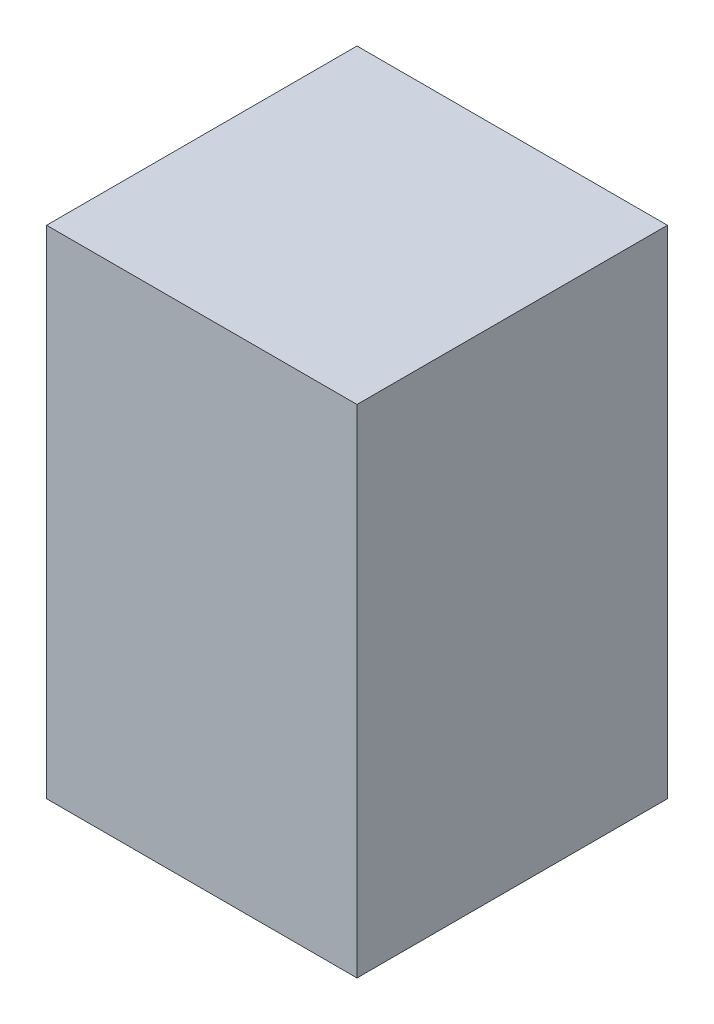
ISO-10303-21;
HEADER;
FILE_DESCRIPTION(('STEP AP214'),'2;1');
FILE_NAME('part.step','',(''),(''),'','','');
FILE_SCHEMA(('AUTOMOTIVE_DESIGN { 1 0 10303 214 1 1 1 1 }'));
ENDSEC;
DATA;
#1=APPLICATION_CONTEXT('core data for automotive mechanical design processes');
#2=APPLICATION_PROTOCOL_DEFINITION('international standard','automotive_design',2000,#1);
#3=PRODUCT_CONTEXT('',#1,'mechanical');
#4=PRODUCT('Part','Part','',(#3));
#5=PRODUCT_RELATED_PRODUCT_CATEGORY('part','',(#4));
#6=PRODUCT_DEFINITION_FORMATION('','',#4);
#7=PRODUCT_DEFINITION_CONTEXT('part definition',#1,'design');
#8=PRODUCT_DEFINITION('design','',#6,#7);
#9=PRODUCT_DEFINITION_SHAPE('','',#8);
#10=(LENGTH_UNIT() NAMED_UNIT(*) SI_UNIT(.MILLI.,.METRE.));
#11=(NAMED_UNIT(*) PLANE_ANGLE_UNIT() SI_UNIT($,.RADIAN.));
#12=(NAMED_UNIT(*) SI_UNIT($,.STERADIAN.) SOLID_ANGLE_UNIT());
#13=UNCERTAINTY_MEASURE_WITH_UNIT(LENGTH_MEASURE(1.E-05),#10,'distance_accuracy_value','');
#14=(GEOMETRIC_REPRESENTATION_CONTEXT(3) GLOBAL_UNCERTAINTY_ASSIGNED_CONTEXT((#13)) GLOBAL_UNIT_ASSIGNED_CONTEXT((#10,
#11,#12)) REPRESENTATION_CONTEXT('',''));
#15=CARTESIAN_POINT('',(0.,0.,0.));
#16=DIRECTION('',(0.,0.,1.));
#17=DIRECTION('',(1.,0.,0.));
#18=AXIS2_PLACEMENT_3D('',#15,#16,#17);
#19=CARTESIAN_POINT('',(-15.875,50.8,15.875));
#20=DIRECTION('',(-1.,0.,0.));
#21=DIRECTION('',(0.,0.,1.));
#22=AXIS2_PLACEMENT_3D('',#19,#20,#21);
#23=PLANE('',#22);
#24=DIRECTION('',(0.,0.,-1.));
#25=VECTOR('',#24,1.);
#26=CARTESIAN_POINT('',(-15.875,0.,15.875));
#27=LINE('',#26,#25);
#28=CARTESIAN_POINT('',(-15.875,0.,15.875));
#29=VERTEX_POINT('',#28);
#30=CARTESIAN_POINT('',(-15.875,0.,-15.875));
#31=VERTEX_POINT('',#30);
#32=EDGE_CURVE('E100',#29,#31,#27,.T.);
#33=ORIENTED_EDGE('',*,*,#32,.F.);
#34=DIRECTION('',(0.,-1.,0.));
#35=VECTOR('',#34,1.);
#36=CARTESIAN_POINT('',(-15.875,50.8,15.875));
#37=LINE('',#36,#35);
#38=CARTESIAN_POINT('',(-15.875,50.8,15.875));
#39=VERTEX_POINT('',#38);
#40=EDGE_CURVE('E11',#39,#29,#37,.T.);
#41=ORIENTED_EDGE('',*,*,#40,.F.);
#42=DIRECTION('',(0.,0.,-1.));
#43=VECTOR('',#42,1.);
#44=CARTESIAN_POINT('',(-15.875,50.8,15.875));
#45=LINE('',#44,#43);
#46=CARTESIAN_POINT('',(-15.875,50.8,-15.875));
#47=VERTEX_POINT('',#46);
#48=EDGE_CURVE('E94',#39,#47,#45,.T.);
#49=ORIENTED_EDGE('',*,*,#48,.T.);
#50=DIRECTION('',(0.,-1.,0.));
#51=VECTOR('',#50,1.);
#52=CARTESIAN_POINT('',(-15.875,50.8,-15.875));
#53=LINE('',#52,#51);
#54=EDGE_CURVE('E37',#47,#31,#53,.T.);
#55=ORIENTED_EDGE('',*,*,#54,.T.);
#56=EDGE_LOOP('',(#33,#41,#49,#55));
#57=FACE_BOUND('',#56,.T.);
#58=ADVANCED_FACE('F34',(#57),#23,.T.);
#59=CARTESIAN_POINT('',(-15.875,50.8,15.875));
#60=DIRECTION('',(0.,0.,-1.));
#61=DIRECTION('',(-1.,0.,0.));
#62=AXIS2_PLACEMENT_3D('',#59,#60,#61);
#63=PLANE('',#62);
#64=DIRECTION('',(1.,0.,0.));
#65=VECTOR('',#64,1.);
#66=CARTESIAN_POINT('',(-15.875,0.,15.875));
#67=LINE('',#66,#65);
#68=CARTESIAN_POINT('',(15.875,0.,15.875));
#69=VERTEX_POINT('',#68);
#70=EDGE_CURVE('E67',#29,#69,#67,.T.);
#71=ORIENTED_EDGE('',*,*,#70,.T.);
#72=DIRECTION('',(0.,-1.,0.));
#73=VECTOR('',#72,1.);
#74=CARTESIAN_POINT('',(15.875,50.8,15.875));
#75=LINE('',#74,#73);
#76=CARTESIAN_POINT('',(15.875,50.8,15.875));
#77=VERTEX_POINT('',#76);
#78=EDGE_CURVE('E43',#77,#69,#75,.T.);
#79=ORIENTED_EDGE('',*,*,#78,.F.);
#80=DIRECTION('',(1.,0.,0.));
#81=VECTOR('',#80,1.);
#82=CARTESIAN_POINT('',(-15.875,50.8,15.875));
#83=LINE('',#82,#81);
#84=EDGE_CURVE('E84',#39,#77,#83,.T.);
#85=ORIENTED_EDGE('',*,*,#84,.F.);
#86=ORIENTED_EDGE('',*,*,#40,.T.);
#87=EDGE_LOOP('',(#71,#79,#85,#86));
#88=FACE_BOUND('',#87,.T.);
#89=ADVANCED_FACE('F111',(#88),#63,.F.);
#90=CARTESIAN_POINT('',(15.875,50.8,15.875));
#91=DIRECTION('',(-1.,0.,0.));
#92=DIRECTION('',(0.,0.,1.));
#93=AXIS2_PLACEMENT_3D('',#90,#91,#92);
#94=PLANE('',#93);
#95=DIRECTION('',(0.,0.,-1.));
#96=VECTOR('',#95,1.);
#97=CARTESIAN_POINT('',(15.875,0.,15.875));
#98=LINE('',#97,#96);
#99=CARTESIAN_POINT('',(15.875,0.,-15.875));
#100=VERTEX_POINT('',#99);
#101=EDGE_CURVE('E91',#69,#100,#98,.T.);
#102=ORIENTED_EDGE('',*,*,#101,.T.);
#103=DIRECTION('',(0.,-1.,0.));
#104=VECTOR('',#103,1.);
#105=CARTESIAN_POINT('',(15.875,50.8,-15.875));
#106=LINE('',#105,#104);
#107=CARTESIAN_POINT('',(15.875,50.8,-15.875));
#108=VERTEX_POINT('',#107);
#109=EDGE_CURVE('E88',#108,#100,#106,.T.);
#110=ORIENTED_EDGE('',*,*,#109,.F.);
#111=DIRECTION('',(0.,0.,-1.));
#112=VECTOR('',#111,1.);
#113=CARTESIAN_POINT('',(15.875,50.8,15.875));
#114=LINE('',#113,#112);
#115=EDGE_CURVE('E79',#77,#108,#114,.T.);
#116=ORIENTED_EDGE('',*,*,#115,.F.);
#117=ORIENTED_EDGE('',*,*,#78,.T.);
#118=EDGE_LOOP('',(#102,#110,#116,#117));
#119=FACE_BOUND('',#118,.T.);
#120=ADVANCED_FACE('F89',(#119),#94,.F.);
#121=CARTESIAN_POINT('',(-15.875,50.8,-15.875));
#122=DIRECTION('',(0.,0.,-1.));
#123=DIRECTION('',(-1.,0.,0.));
#124=AXIS2_PLACEMENT_3D('',#121,#122,#123);
#125=PLANE('',#124);
#126=DIRECTION('',(1.,0.,0.));
#127=VECTOR('',#126,1.);
#128=CARTESIAN_POINT('',(-15.875,0.,-15.875));
#129=LINE('',#128,#127);
#130=EDGE_CURVE('E103',#31,#100,#129,.T.);
#131=ORIENTED_EDGE('',*,*,#130,.F.);
#132=ORIENTED_EDGE('',*,*,#54,.F.);
#133=DIRECTION('',(1.,0.,0.));
#134=VECTOR('',#133,1.);
#135=CARTESIAN_POINT('',(-15.875,50.8,-15.875));
#136=LINE('',#135,#134);
#137=EDGE_CURVE('E83',#47,#108,#136,.T.);
#138=ORIENTED_EDGE('',*,*,#137,.T.);
#139=ORIENTED_EDGE('',*,*,#109,.T.);
#140=EDGE_LOOP('',(#131,#132,#138,#139));
#141=FACE_BOUND('',#140,.T.);
#142=ADVANCED_FACE('F93',(#141),#125,.T.);
#143=CARTESIAN_POINT('',(0.,50.8,0.));
#144=DIRECTION('',(0.,-1.,0.));
#145=DIRECTION('',(0.,0.,-1.));
#146=AXIS2_PLACEMENT_3D('',#143,#144,#145);
#147=PLANE('',#146);
#148=ORIENTED_EDGE('',*,*,#48,.F.);
#149=ORIENTED_EDGE('',*,*,#84,.T.);
#150=ORIENTED_EDGE('',*,*,#115,.T.);
#151=ORIENTED_EDGE('',*,*,#137,.F.);
#152=EDGE_LOOP('',(#148,#149,#150,#151));
#153=FACE_BOUND('',#152,.T.);
#154=ADVANCED_FACE('F82',(#153),#147,.F.);
#155=CARTESIAN_POINT('',(0.,0.,0.));
#156=DIRECTION('',(0.,-1.,0.));
#157=DIRECTION('',(0.,0.,-1.));
#158=AXIS2_PLACEMENT_3D('',#155,#156,#157);
#159=PLANE('',#158);
#160=CARTESIAN_POINT('',(0.,0.,0.));
#161=DIRECTION('',(0.,-1.,0.));
#162=DIRECTION('',(0.,0.,-1.));
#163=AXIS2_PLACEMENT_3D('',#160,#161,#162);
#164=CIRCLE('',#163,4.7625);
#165=CARTESIAN_POINT('',(0.,0.,-4.7625));
#166=VERTEX_POINT('',#165);
#167=EDGE_CURVE('E142',#166,#166,#164,.T.);
#168=ORIENTED_EDGE('',*,*,#167,.F.);
#169=EDGE_LOOP('',(#168));
#170=FACE_BOUND('',#169,.T.);
#171=ORIENTED_EDGE('',*,*,#32,.T.);
#172=ORIENTED_EDGE('',*,*,#130,.T.);
#173=ORIENTED_EDGE('',*,*,#101,.F.);
#174=ORIENTED_EDGE('',*,*,#70,.F.);
#175=EDGE_LOOP('',(#171,#172,#173,#174));
#176=FACE_BOUND('',#175,.T.);
#177=ADVANCED_FACE('F109',(#170,#176),#159,.T.);
#178=CARTESIAN_POINT('',(0.,38.1,0.));
#179=DIRECTION('',(0.,-1.,0.));
#180=DIRECTION('',(0.,0.,-1.));
#181=AXIS2_PLACEMENT_3D('',#178,#179,#180);
#182=CYLINDRICAL_SURFACE('',#181,4.7625);
#183=CARTESIAN_POINT('',(0.,38.1,0.));
#184=DIRECTION('',(0.,-1.,0.));
#185=DIRECTION('',(0.,0.,-1.));
#186=AXIS2_PLACEMENT_3D('',#183,#184,#185);
#187=CIRCLE('',#186,4.7625);
#188=CARTESIAN_POINT('',(0.,38.1,-4.7625));
#189=VERTEX_POINT('',#188);
#190=EDGE_CURVE('E104',#189,#189,#187,.T.);
#191=CARTESIAN_POINT('',(0.,38.1,-4.7625));
#192=CARTESIAN_POINT('',(0.,37.703125,-4.7625));
#193=CARTESIAN_POINT('',(0.,37.30625,-4.7625));
#194=CARTESIAN_POINT('',(0.,36.5125,-4.7625));
#195=CARTESIAN_POINT('',(0.,36.115625,-4.7625));
#196=CARTESIAN_POINT('',(0.,35.321875,-4.7625));
#197=CARTESIAN_POINT('',(0.,34.925,-4.7625));
#198=CARTESIAN_POINT('',(0.,34.13125,-4.7625));
#199=CARTESIAN_POINT('',(0.,33.734375,-4.7625));
#200=CARTESIAN_POINT('',(0.,32.940625,-4.7625));
#201=CARTESIAN_POINT('',(0.,32.54375,-4.7625));
#202=CARTESIAN_POINT('',(0.,31.75,-4.7625));
#203=CARTESIAN_POINT('',(0.,31.353125,-4.7625));
#204=CARTESIAN_POINT('',(0.,30.559375,-4.7625));
#205=CARTESIAN_POINT('',(0.,30.1625,-4.7625));
#206=CARTESIAN_POINT('',(0.,29.36875,-4.7625));
#207=CARTESIAN_POINT('',(0.,28.971875,-4.7625));
#208=CARTESIAN_POINT('',(0.,28.178125,-4.7625));
#209=CARTESIAN_POINT('',(0.,27.78125,-4.7625));
#210=CARTESIAN_POINT('',(0.,26.9875,-4.7625));
#211=CARTESIAN_POINT('',(0.,26.590625,-4.7625));
#212=CARTESIAN_POINT('',(0.,25.796875,-4.7625));
#213=CARTESIAN_POINT('',(0.,25.4,-4.7625));
#214=CARTESIAN_POINT('',(0.,24.60625,-4.7625));
#215=CARTESIAN_POINT('',(0.,24.209375,-4.7625));
#216=CARTESIAN_POINT('',(0.,23.415625,-4.7625));
#217=CARTESIAN_POINT('',(0.,23.01875,-4.7625));
#218=CARTESIAN_POINT('',(0.,22.225,-4.7625));
#219=CARTESIAN_POINT('',(0.,21.828125,-4.7625));
#220=CARTESIAN_POINT('',(0.,21.034375,-4.7625));
#221=CARTESIAN_POINT('',(0.,20.6375,-4.7625));
#222=CARTESIAN_POINT('',(0.,19.84375,-4.7625));
#223=CARTESIAN_POINT('',(0.,19.446875,-4.7625));
#224=CARTESIAN_POINT('',(0.,18.653125,-4.7625));
#225=CARTESIAN_POINT('',(0.,18.25625,-4.7625));
#226=CARTESIAN_POINT('',(0.,17.4625,-4.7625));
#227=CARTESIAN_POINT('',(0.,17.065625,-4.7625));
#228=CARTESIAN_POINT('',(0.,16.271875,-4.7625));
#229=CARTESIAN_POINT('',(0.,15.875,-4.7625));
#230=CARTESIAN_POINT('',(0.,15.08125,-4.7625));
#231=CARTESIAN_POINT('',(0.,14.684375,-4.7625));
#232=CARTESIAN_POINT('',(0.,13.890625,-4.7625));
#233=CARTESIAN_POINT('',(0.,13.49375,-4.7625));
#234=CARTESIAN_POINT('',(0.,12.7,-4.7625));
#235=CARTESIAN_POINT('',(0.,12.303125,-4.7625));
#236=CARTESIAN_POINT('',(0.,11.509375,-4.7625));
#237=CARTESIAN_POINT('',(0.,11.1125,-4.7625));
#238=CARTESIAN_POINT('',(0.,10.31875,-4.7625));
#239=CARTESIAN_POINT('',(0.,9.921875,-4.7625));
#240=CARTESIAN_POINT('',(0.,9.128125,-4.7625));
#241=CARTESIAN_POINT('',(0.,8.73125,-4.7625));
#242=CARTESIAN_POINT('',(0.,7.9375,-4.7625));
#243=CARTESIAN_POINT('',(0.,7.540625,-4.7625));
#244=CARTESIAN_POINT('',(0.,6.746875,-4.7625));
#245=CARTESIAN_POINT('',(0.,6.35,-4.7625));
#246=CARTESIAN_POINT('',(0.,5.55625,-4.7625));
#247=CARTESIAN_POINT('',(0.,5.159375,-4.7625));
#248=CARTESIAN_POINT('',(0.,4.365625,-4.7625));
#249=CARTESIAN_POINT('',(0.,3.96875,-4.7625));
#250=CARTESIAN_POINT('',(0.,3.175,-4.7625));
#251=CARTESIAN_POINT('',(0.,2.778125,-4.7625));
#252=CARTESIAN_POINT('',(0.,1.984375,-4.7625));
#253=CARTESIAN_POINT('',(0.,1.5875,-4.7625));
#254=CARTESIAN_POINT('',(0.,0.79375,-4.7625));
#255=CARTESIAN_POINT('',(0.,0.396875,-4.7625));
#256=CARTESIAN_POINT('',(0.,0.,-4.7625));
#257=B_SPLINE_CURVE_WITH_KNOTS('',3,(#191,#192,#193,#194,#195,#196,#197,#198,#199,#200,#201,
#202,#203,#204,#205,#206,#207,#208,#209,#210,#211,#212,#213,#214,#215,#216,#217,#218,#219,#220,
#221,#222,#223,#224,#225,#226,#227,#228,#229,#230,#231,#232,#233,#234,#235,#236,#237,#238,#239,
#240,#241,#242,#243,#244,#245,#246,#247,#248,#249,#250,#251,#252,#253,#254,#255,#256),
.UNSPECIFIED.,.F.,.F.,(4,2,2,2,2,2,2,2,2,2,2,2,2,2,2,2,2,2,2,2,2,2,2,2,2,2,2,2,2,2,2,2,4),(0.,
1.19062499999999,2.38124999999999,3.571875,4.7625,5.953125,7.14375,8.334375,9.525,10.715625,
11.90625,13.096875,14.2875,15.478125,16.66875,17.859375,19.05,20.240625,21.43125,22.621875,
23.8125,25.003125,26.19375,27.384375,28.575,29.765625,30.95625,32.146875,33.3375,34.528125,
35.71875,36.909375,38.1),.UNSPECIFIED.);
#258=EDGE_CURVE('BSEAM129',#189,#166,#257,.T.);
#259=ORIENTED_EDGE('',*,*,#190,.F.);
#260=ORIENTED_EDGE('',*,*,#167,.T.);
#261=ORIENTED_EDGE('',*,*,#258,.T.);
#262=ORIENTED_EDGE('',*,*,#258,.F.);
#263=EDGE_LOOP('',(#259,#261,#260,#262));
#264=FACE_BOUND('',#263,.T.);
#265=ADVANCED_FACE('F129',(#264),#182,.F.);
#266=CARTESIAN_POINT('',(0.,38.1,0.));
#267=DIRECTION('',(0.,-1.,0.));
#268=DIRECTION('',(0.,0.,-1.));
#269=AXIS2_PLACEMENT_3D('',#266,#267,#268);
#270=PLANE('',#269);
#271=ORIENTED_EDGE('',*,*,#190,.T.);
#272=EDGE_LOOP('',(#271));
#273=FACE_BOUND('',#272,.T.);
#274=ADVANCED_FACE('F134',(#273),#270,.T.);
#275=CLOSED_SHELL('',(#58,#89,#120,#142,#154,#177,#265,#274));
#276=MANIFOLD_SOLID_BREP('B2',#275);
#277=ADVANCED_BREP_SHAPE_REPRESENTATION('',(#18,#276),#14);
#278=SHAPE_DEFINITION_REPRESENTATION(#9,#277);
ENDSEC;
END-ISO-10303-21;
